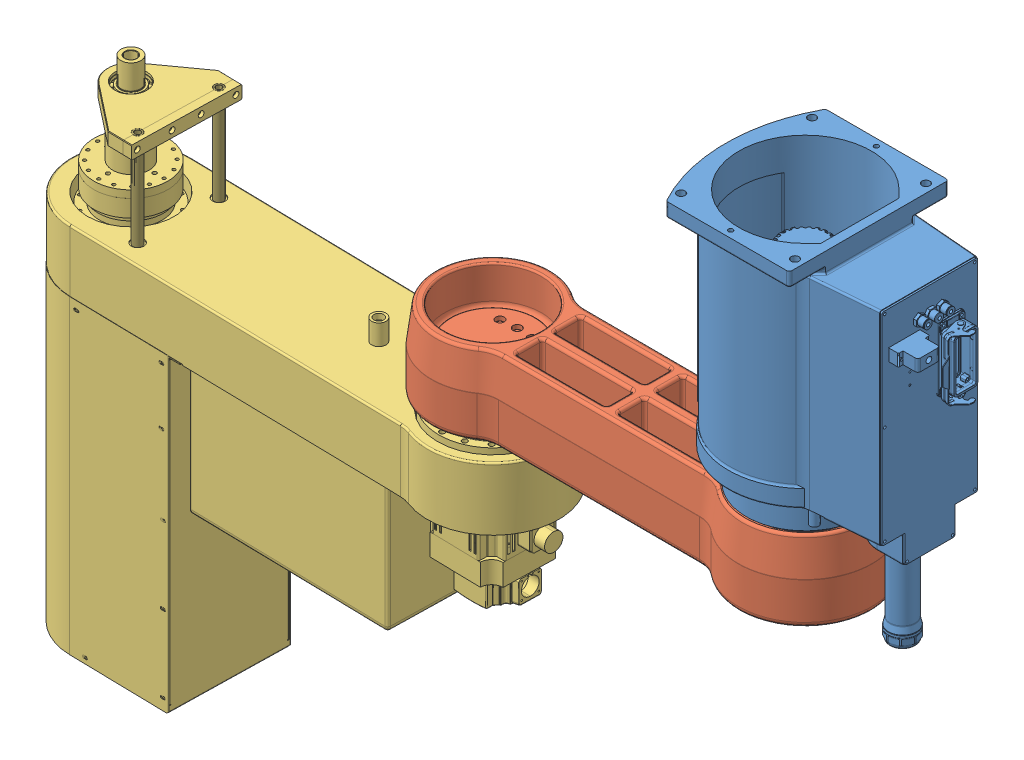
SolidWorks assembly 装配体1.sldasm, configuration 默认 (file format 11000). Lengths in mm.
Overall size (1571.9 1264 280).
3 component instances, 3 part files, 4 mates.
Components (placement in the parent):
- STH500-1200-1-1: STH500-1200-1.SLDPRT [默认] at (627.0728 105.377 0) size (1456.15 739 280)
- STH500-1200-2-1: STH500-1200-2.SLDPRT [默认] at (627.0723 105.377 0.3792) x (0.999996 0 0.002676) z (-0.002676 0 0.999996) size (782.82 176 247.41)
- STH500-1200-3-1: STH500-1200-3.SLDPRT [默认] at (626.9222 105.377 13.0566) x (0.999779 0 0.021003) z (-0.021003 0 0.999779) size (870.66 861 230)
Mates (geometry in assembly coordinates):
- 同心1: concentric: cylinder of STH500-1200-1-1 through (485.3617 -32.003 0) axis (0 1 0) radius 103.5; cylinder of STH500-1200-2-1 through (485.3617 -46.503 0) axis (0 1 0) radius 91
- 重合1: coincident: plane of STH500-1200-1-1 through (613.8883 -46.503 34.3827) normal (0 -1 0); plane of STH500-1200-2-1 through (485.3617 -46.503 0) normal (0 1 0)
- 重合2: coincident: plane of STH500-1200-2-1 through (-62.8098 -156.503 44.8105) normal (0 -1 0); plane of STH500-1200-3-1 through (-108.5598 -156.503 44.8105) normal (0 1 0)
- 同心2: concentric: cylinder of STH500-1200-2-1 through (-62.8098 -161.503 44.8105) axis (0 -1 0) radius 81.5; cylinder of STH500-1200-3-1 through (-62.8098 -170.403 44.8105) axis (0 -1 0) radius 79
